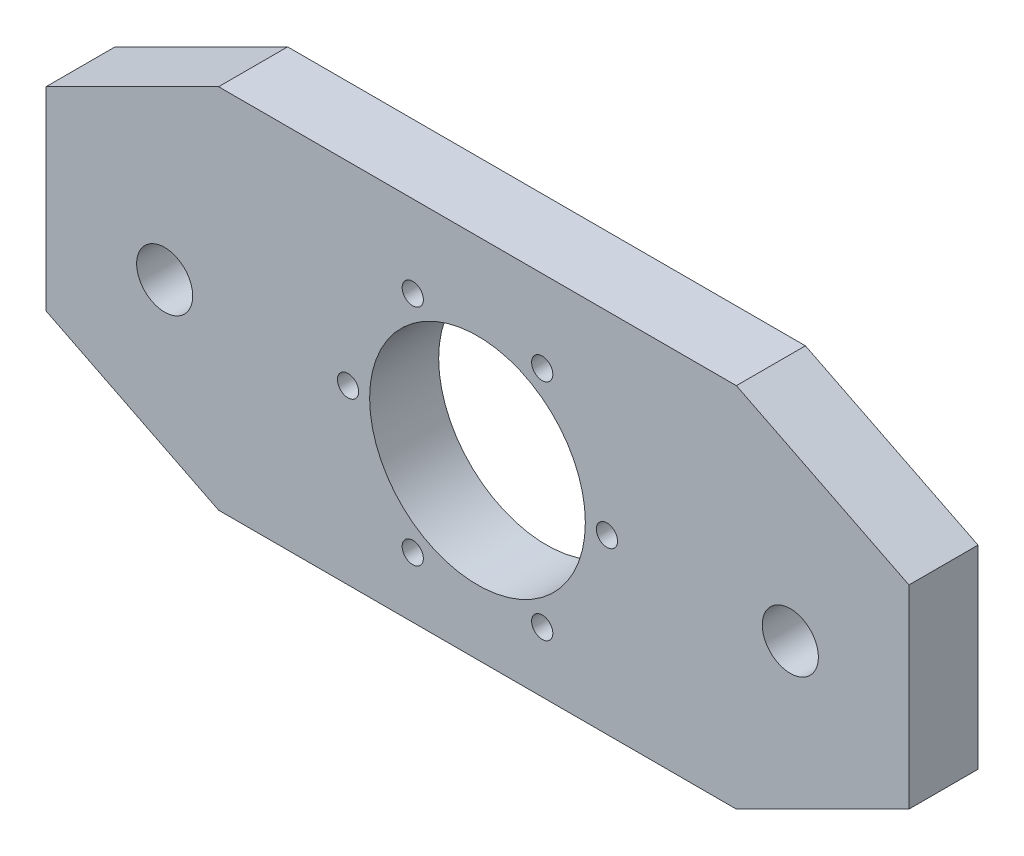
ISO-10303-21;
HEADER;
FILE_DESCRIPTION(('STEP AP214'),'2;1');
FILE_NAME('part.step','',(''),(''),'','','');
FILE_SCHEMA(('AUTOMOTIVE_DESIGN { 1 0 10303 214 1 1 1 1 }'));
ENDSEC;
DATA;
#1=APPLICATION_CONTEXT('core data for automotive mechanical design processes');
#2=APPLICATION_PROTOCOL_DEFINITION('international standard','automotive_design',2000,#1);
#3=PRODUCT_CONTEXT('',#1,'mechanical');
#4=PRODUCT('Part','Part','',(#3));
#5=PRODUCT_RELATED_PRODUCT_CATEGORY('part','',(#4));
#6=PRODUCT_DEFINITION_FORMATION('','',#4);
#7=PRODUCT_DEFINITION_CONTEXT('part definition',#1,'design');
#8=PRODUCT_DEFINITION('design','',#6,#7);
#9=PRODUCT_DEFINITION_SHAPE('','',#8);
#10=(LENGTH_UNIT() NAMED_UNIT(*) SI_UNIT(.MILLI.,.METRE.));
#11=(NAMED_UNIT(*) PLANE_ANGLE_UNIT() SI_UNIT($,.RADIAN.));
#12=(NAMED_UNIT(*) SI_UNIT($,.STERADIAN.) SOLID_ANGLE_UNIT());
#13=UNCERTAINTY_MEASURE_WITH_UNIT(LENGTH_MEASURE(1.E-05),#10,'distance_accuracy_value','');
#14=(GEOMETRIC_REPRESENTATION_CONTEXT(3) GLOBAL_UNCERTAINTY_ASSIGNED_CONTEXT((#13)) GLOBAL_UNIT_ASSIGNED_CONTEXT((#10,
#11,#12)) REPRESENTATION_CONTEXT('',''));
#15=CARTESIAN_POINT('',(0.,0.,0.));
#16=DIRECTION('',(0.,0.,1.));
#17=DIRECTION('',(1.,0.,0.));
#18=AXIS2_PLACEMENT_3D('',#15,#16,#17);
#19=CARTESIAN_POINT('',(69.2307696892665,37.6193639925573,0.));
#20=DIRECTION('',(0.,0.,1.));
#21=DIRECTION('',(1.,0.,0.));
#22=AXIS2_PLACEMENT_3D('',#19,#20,#21);
#23=PLANE('',#22);
#24=CARTESIAN_POINT('',(141.730769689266,35.1193639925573,0.));
#25=DIRECTION('',(0.,0.,-1.));
#26=DIRECTION('',(-1.,0.,0.));
#27=AXIS2_PLACEMENT_3D('',#24,#25,#26);
#28=CIRCLE('',#27,6.5);
#29=CARTESIAN_POINT('',(135.230769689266,35.1193639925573,0.));
#30=VERTEX_POINT('',#29);
#31=EDGE_CURVE('E152',#30,#30,#28,.F.);
#32=ORIENTED_EDGE('',*,*,#31,.T.);
#33=EDGE_LOOP('',(#32));
#34=FACE_BOUND('',#33,.T.);
#35=CARTESIAN_POINT('',(-3.26923031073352,35.1193639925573,0.));
#36=DIRECTION('',(0.,0.,-1.));
#37=DIRECTION('',(-1.,0.,0.));
#38=AXIS2_PLACEMENT_3D('',#35,#36,#37);
#39=CIRCLE('',#38,6.5);
#40=CARTESIAN_POINT('',(-9.76923031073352,35.1193639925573,0.));
#41=VERTEX_POINT('',#40);
#42=EDGE_CURVE('E178',#41,#41,#39,.F.);
#43=ORIENTED_EDGE('',*,*,#42,.T.);
#44=EDGE_LOOP('',(#43));
#45=FACE_BOUND('',#44,.T.);
#46=CARTESIAN_POINT('',(69.2307696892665,35.1193639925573,0.));
#47=DIRECTION('',(0.,0.,-1.));
#48=DIRECTION('',(-1.,0.,0.));
#49=AXIS2_PLACEMENT_3D('',#46,#47,#48);
#50=CIRCLE('',#49,25.);
#51=CARTESIAN_POINT('',(44.2307696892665,35.1193639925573,0.));
#52=VERTEX_POINT('',#51);
#53=EDGE_CURVE('E181',#52,#52,#50,.F.);
#54=ORIENTED_EDGE('',*,*,#53,.T.);
#55=EDGE_LOOP('',(#54));
#56=FACE_BOUND('',#55,.T.);
#57=CARTESIAN_POINT('',(99.2307696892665,35.1193639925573,0.));
#58=DIRECTION('',(0.,0.,-1.));
#59=DIRECTION('',(-1.,0.,0.));
#60=AXIS2_PLACEMENT_3D('',#57,#58,#59);
#61=CIRCLE('',#60,2.4585);
#62=CARTESIAN_POINT('',(96.7722696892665,35.1193639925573,0.));
#63=VERTEX_POINT('',#62);
#64=EDGE_CURVE('E184',#63,#63,#61,.F.);
#65=ORIENTED_EDGE('',*,*,#64,.T.);
#66=EDGE_LOOP('',(#65));
#67=FACE_BOUND('',#66,.T.);
#68=CARTESIAN_POINT('',(84.2307696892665,9.13860187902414,0.));
#69=DIRECTION('',(0.,0.,-1.));
#70=DIRECTION('',(-1.,0.,0.));
#71=AXIS2_PLACEMENT_3D('',#68,#69,#70);
#72=CIRCLE('',#71,2.45849999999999);
#73=CARTESIAN_POINT('',(81.7722696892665,9.13860187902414,0.));
#74=VERTEX_POINT('',#73);
#75=EDGE_CURVE('E187',#74,#74,#72,.F.);
#76=ORIENTED_EDGE('',*,*,#75,.T.);
#77=EDGE_LOOP('',(#76));
#78=FACE_BOUND('',#77,.T.);
#79=CARTESIAN_POINT('',(84.2307696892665,61.1001261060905,0.));
#80=DIRECTION('',(0.,0.,-1.));
#81=DIRECTION('',(-1.,0.,0.));
#82=AXIS2_PLACEMENT_3D('',#79,#80,#81);
#83=CIRCLE('',#82,2.45850000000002);
#84=CARTESIAN_POINT('',(81.7722696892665,61.1001261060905,0.));
#85=VERTEX_POINT('',#84);
#86=EDGE_CURVE('E190',#85,#85,#83,.F.);
#87=ORIENTED_EDGE('',*,*,#86,.T.);
#88=EDGE_LOOP('',(#87));
#89=FACE_BOUND('',#88,.T.);
#90=CARTESIAN_POINT('',(54.2307696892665,61.1001261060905,0.));
#91=DIRECTION('',(0.,0.,-1.));
#92=DIRECTION('',(-1.,0.,0.));
#93=AXIS2_PLACEMENT_3D('',#90,#91,#92);
#94=CIRCLE('',#93,2.45850000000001);
#95=CARTESIAN_POINT('',(51.7722696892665,61.1001261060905,0.));
#96=VERTEX_POINT('',#95);
#97=EDGE_CURVE('E193',#96,#96,#94,.F.);
#98=ORIENTED_EDGE('',*,*,#97,.T.);
#99=EDGE_LOOP('',(#98));
#100=FACE_BOUND('',#99,.T.);
#101=CARTESIAN_POINT('',(39.2307696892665,35.1193639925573,0.));
#102=DIRECTION('',(0.,0.,-1.));
#103=DIRECTION('',(-1.,0.,0.));
#104=AXIS2_PLACEMENT_3D('',#101,#102,#103);
#105=CIRCLE('',#104,2.4585);
#106=CARTESIAN_POINT('',(36.7722696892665,35.1193639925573,0.));
#107=VERTEX_POINT('',#106);
#108=EDGE_CURVE('E195',#107,#107,#105,.F.);
#109=ORIENTED_EDGE('',*,*,#108,.T.);
#110=EDGE_LOOP('',(#109));
#111=FACE_BOUND('',#110,.T.);
#112=CARTESIAN_POINT('',(54.2307696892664,9.13860187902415,0.));
#113=DIRECTION('',(0.,0.,-1.));
#114=DIRECTION('',(-1.,0.,0.));
#115=AXIS2_PLACEMENT_3D('',#112,#113,#114);
#116=CIRCLE('',#115,2.4585);
#117=CARTESIAN_POINT('',(51.7722696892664,9.13860187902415,0.));
#118=VERTEX_POINT('',#117);
#119=EDGE_CURVE('E20',#118,#118,#116,.F.);
#120=ORIENTED_EDGE('',*,*,#119,.T.);
#121=EDGE_LOOP('',(#120));
#122=FACE_BOUND('',#121,.T.);
#123=DIRECTION('',(1.,0.,0.));
#124=VECTOR('',#123,1.);
#125=CARTESIAN_POINT('',(9.23076968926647,80.1193639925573,0.));
#126=LINE('',#125,#124);
#127=CARTESIAN_POINT('',(129.230769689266,80.1193639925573,0.));
#128=VERTEX_POINT('',#127);
#129=CARTESIAN_POINT('',(9.2307696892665,80.1193639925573,0.));
#130=VERTEX_POINT('',#129);
#131=EDGE_CURVE('E68',#128,#130,#126,.F.);
#132=ORIENTED_EDGE('',*,*,#131,.F.);
#133=DIRECTION('',(-0.894427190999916,0.447213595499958,0.));
#134=VECTOR('',#133,1.);
#135=CARTESIAN_POINT('',(129.230769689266,80.1193639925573,0.));
#136=LINE('',#135,#134);
#137=CARTESIAN_POINT('',(169.230769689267,60.1193639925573,0.));
#138=VERTEX_POINT('',#137);
#139=EDGE_CURVE('E129',#138,#128,#136,.T.);
#140=ORIENTED_EDGE('',*,*,#139,.F.);
#141=DIRECTION('',(0.,1.,0.));
#142=VECTOR('',#141,1.);
#143=CARTESIAN_POINT('',(169.230769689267,60.1193639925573,0.));
#144=LINE('',#143,#142);
#145=CARTESIAN_POINT('',(169.230769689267,15.1193639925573,0.));
#146=VERTEX_POINT('',#145);
#147=EDGE_CURVE('E124',#146,#138,#144,.T.);
#148=ORIENTED_EDGE('',*,*,#147,.F.);
#149=DIRECTION('',(0.894427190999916,0.447213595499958,0.));
#150=VECTOR('',#149,1.);
#151=CARTESIAN_POINT('',(169.230769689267,15.1193639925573,0.));
#152=LINE('',#151,#150);
#153=CARTESIAN_POINT('',(129.230769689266,-4.88063600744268,0.));
#154=VERTEX_POINT('',#153);
#155=EDGE_CURVE('E119',#154,#146,#152,.T.);
#156=ORIENTED_EDGE('',*,*,#155,.F.);
#157=DIRECTION('',(1.,0.,0.));
#158=VECTOR('',#157,1.);
#159=CARTESIAN_POINT('',(129.230769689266,-4.88063600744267,0.));
#160=LINE('',#159,#158);
#161=CARTESIAN_POINT('',(9.23076968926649,-4.88063600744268,0.));
#162=VERTEX_POINT('',#161);
#163=EDGE_CURVE('E114',#162,#154,#160,.T.);
#164=ORIENTED_EDGE('',*,*,#163,.F.);
#165=DIRECTION('',(0.894427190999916,-0.447213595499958,0.));
#166=VECTOR('',#165,1.);
#167=CARTESIAN_POINT('',(9.23076968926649,-4.88063600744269,0.));
#168=LINE('',#167,#166);
#169=CARTESIAN_POINT('',(-30.7692303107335,15.1193639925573,0.));
#170=VERTEX_POINT('',#169);
#171=EDGE_CURVE('E109',#170,#162,#168,.T.);
#172=ORIENTED_EDGE('',*,*,#171,.F.);
#173=DIRECTION('',(0.,1.,0.));
#174=VECTOR('',#173,1.);
#175=CARTESIAN_POINT('',(-30.7692303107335,15.1193639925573,0.));
#176=LINE('',#175,#174);
#177=CARTESIAN_POINT('',(-30.7692303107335,60.1193639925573,0.));
#178=VERTEX_POINT('',#177);
#179=EDGE_CURVE('E96',#178,#170,#176,.F.);
#180=ORIENTED_EDGE('',*,*,#179,.F.);
#181=DIRECTION('',(-0.894427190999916,-0.447213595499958,0.));
#182=VECTOR('',#181,1.);
#183=CARTESIAN_POINT('',(-30.7692303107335,60.1193639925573,0.));
#184=LINE('',#183,#182);
#185=EDGE_CURVE('E94',#130,#178,#184,.T.);
#186=ORIENTED_EDGE('',*,*,#185,.F.);
#187=EDGE_LOOP('',(#132,#140,#148,#156,#164,#172,#180,#186));
#188=FACE_BOUND('',#187,.T.);
#189=ADVANCED_FACE('F16',(#34,#45,#56,#67,#78,#89,#100,#111,#122,#188),#23,.F.);
#190=CARTESIAN_POINT('',(9.23076968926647,80.1193639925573,0.));
#191=DIRECTION('',(0.,1.,0.));
#192=DIRECTION('',(0.,0.,1.));
#193=AXIS2_PLACEMENT_3D('',#190,#191,#192);
#194=PLANE('',#193);
#195=ORIENTED_EDGE('',*,*,#131,.T.);
#196=DIRECTION('',(0.,0.,1.));
#197=VECTOR('',#196,1.);
#198=CARTESIAN_POINT('',(9.23076968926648,80.1193639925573,0.));
#199=LINE('',#198,#197);
#200=CARTESIAN_POINT('',(9.23076968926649,80.1193639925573,16.));
#201=VERTEX_POINT('',#200);
#202=EDGE_CURVE('E88',#201,#130,#199,.F.);
#203=ORIENTED_EDGE('',*,*,#202,.F.);
#204=DIRECTION('',(1.,0.,0.));
#205=VECTOR('',#204,1.);
#206=CARTESIAN_POINT('',(69.2307696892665,80.1193639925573,16.));
#207=LINE('',#206,#205);
#208=CARTESIAN_POINT('',(129.230769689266,80.1193639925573,16.));
#209=VERTEX_POINT('',#208);
#210=EDGE_CURVE('E61',#209,#201,#207,.F.);
#211=ORIENTED_EDGE('',*,*,#210,.F.);
#212=DIRECTION('',(0.,0.,1.));
#213=VECTOR('',#212,1.);
#214=CARTESIAN_POINT('',(129.230769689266,80.1193639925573,0.));
#215=LINE('',#214,#213);
#216=EDGE_CURVE('E90',#128,#209,#215,.T.);
#217=ORIENTED_EDGE('',*,*,#216,.F.);
#218=EDGE_LOOP('',(#195,#203,#211,#217));
#219=FACE_BOUND('',#218,.T.);
#220=ADVANCED_FACE('F86',(#219),#194,.T.);
#221=CARTESIAN_POINT('',(-30.7692303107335,60.1193639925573,0.));
#222=DIRECTION('',(-0.447213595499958,0.894427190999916,0.));
#223=DIRECTION('',(-0.894427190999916,-0.447213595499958,0.));
#224=AXIS2_PLACEMENT_3D('',#221,#222,#223);
#225=PLANE('',#224);
#226=ORIENTED_EDGE('',*,*,#185,.T.);
#227=DIRECTION('',(0.,0.,1.));
#228=VECTOR('',#227,1.);
#229=CARTESIAN_POINT('',(-30.7692303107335,60.1193639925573,0.));
#230=LINE('',#229,#228);
#231=CARTESIAN_POINT('',(-30.7692303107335,60.1193639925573,16.));
#232=VERTEX_POINT('',#231);
#233=EDGE_CURVE('E99',#232,#178,#230,.F.);
#234=ORIENTED_EDGE('',*,*,#233,.F.);
#235=DIRECTION('',(-0.894427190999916,-0.447213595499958,0.));
#236=VECTOR('',#235,1.);
#237=CARTESIAN_POINT('',(9.23076968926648,80.1193639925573,16.));
#238=LINE('',#237,#236);
#239=EDGE_CURVE('E103',#201,#232,#238,.T.);
#240=ORIENTED_EDGE('',*,*,#239,.F.);
#241=ORIENTED_EDGE('',*,*,#202,.T.);
#242=EDGE_LOOP('',(#226,#234,#240,#241));
#243=FACE_BOUND('',#242,.T.);
#244=ADVANCED_FACE('F101',(#243),#225,.T.);
#245=CARTESIAN_POINT('',(-30.7692303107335,15.1193639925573,0.));
#246=DIRECTION('',(-1.,0.,0.));
#247=DIRECTION('',(0.,0.,1.));
#248=AXIS2_PLACEMENT_3D('',#245,#246,#247);
#249=PLANE('',#248);
#250=ORIENTED_EDGE('',*,*,#179,.T.);
#251=DIRECTION('',(0.,0.,1.));
#252=VECTOR('',#251,1.);
#253=CARTESIAN_POINT('',(-30.7692303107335,15.1193639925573,0.));
#254=LINE('',#253,#252);
#255=CARTESIAN_POINT('',(-30.7692303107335,15.1193639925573,16.));
#256=VERTEX_POINT('',#255);
#257=EDGE_CURVE('E107',#256,#170,#254,.F.);
#258=ORIENTED_EDGE('',*,*,#257,.F.);
#259=DIRECTION('',(0.,1.,0.));
#260=VECTOR('',#259,1.);
#261=CARTESIAN_POINT('',(-30.7692303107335,37.6193639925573,16.));
#262=LINE('',#261,#260);
#263=EDGE_CURVE('E148',#232,#256,#262,.F.);
#264=ORIENTED_EDGE('',*,*,#263,.F.);
#265=ORIENTED_EDGE('',*,*,#233,.T.);
#266=EDGE_LOOP('',(#250,#258,#264,#265));
#267=FACE_BOUND('',#266,.T.);
#268=ADVANCED_FACE('F243',(#267),#249,.T.);
#269=CARTESIAN_POINT('',(9.23076968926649,-4.88063600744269,0.));
#270=DIRECTION('',(-0.447213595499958,-0.894427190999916,0.));
#271=DIRECTION('',(0.894427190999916,-0.447213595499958,0.));
#272=AXIS2_PLACEMENT_3D('',#269,#270,#271);
#273=PLANE('',#272);
#274=ORIENTED_EDGE('',*,*,#171,.T.);
#275=DIRECTION('',(0.,0.,-1.));
#276=VECTOR('',#275,1.);
#277=CARTESIAN_POINT('',(9.23076968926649,-4.88063600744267,0.));
#278=LINE('',#277,#276);
#279=CARTESIAN_POINT('',(9.23076968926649,-4.88063600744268,16.));
#280=VERTEX_POINT('',#279);
#281=EDGE_CURVE('E111',#280,#162,#278,.T.);
#282=ORIENTED_EDGE('',*,*,#281,.F.);
#283=DIRECTION('',(0.894427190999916,-0.447213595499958,0.));
#284=VECTOR('',#283,1.);
#285=CARTESIAN_POINT('',(-30.7692303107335,15.1193639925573,16.));
#286=LINE('',#285,#284);
#287=EDGE_CURVE('E145',#256,#280,#286,.T.);
#288=ORIENTED_EDGE('',*,*,#287,.F.);
#289=ORIENTED_EDGE('',*,*,#257,.T.);
#290=EDGE_LOOP('',(#274,#282,#288,#289));
#291=FACE_BOUND('',#290,.T.);
#292=ADVANCED_FACE('F239',(#291),#273,.T.);
#293=CARTESIAN_POINT('',(129.230769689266,-4.88063600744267,0.));
#294=DIRECTION('',(0.,-1.,0.));
#295=DIRECTION('',(0.,0.,-1.));
#296=AXIS2_PLACEMENT_3D('',#293,#294,#295);
#297=PLANE('',#296);
#298=ORIENTED_EDGE('',*,*,#163,.T.);
#299=DIRECTION('',(0.,0.,1.));
#300=VECTOR('',#299,1.);
#301=CARTESIAN_POINT('',(129.230769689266,-4.88063600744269,0.));
#302=LINE('',#301,#300);
#303=CARTESIAN_POINT('',(129.230769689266,-4.88063600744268,16.));
#304=VERTEX_POINT('',#303);
#305=EDGE_CURVE('E116',#304,#154,#302,.F.);
#306=ORIENTED_EDGE('',*,*,#305,.F.);
#307=DIRECTION('',(1.,0.,0.));
#308=VECTOR('',#307,1.);
#309=CARTESIAN_POINT('',(69.2307696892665,-4.88063600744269,16.));
#310=LINE('',#309,#308);
#311=EDGE_CURVE('E142',#280,#304,#310,.T.);
#312=ORIENTED_EDGE('',*,*,#311,.F.);
#313=ORIENTED_EDGE('',*,*,#281,.T.);
#314=EDGE_LOOP('',(#298,#306,#312,#313));
#315=FACE_BOUND('',#314,.T.);
#316=ADVANCED_FACE('F235',(#315),#297,.T.);
#317=CARTESIAN_POINT('',(169.230769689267,15.1193639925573,0.));
#318=DIRECTION('',(0.447213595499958,-0.894427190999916,0.));
#319=DIRECTION('',(0.894427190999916,0.447213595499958,0.));
#320=AXIS2_PLACEMENT_3D('',#317,#318,#319);
#321=PLANE('',#320);
#322=ORIENTED_EDGE('',*,*,#155,.T.);
#323=DIRECTION('',(0.,0.,-1.));
#324=VECTOR('',#323,1.);
#325=CARTESIAN_POINT('',(169.230769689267,15.1193639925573,0.));
#326=LINE('',#325,#324);
#327=CARTESIAN_POINT('',(169.230769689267,15.1193639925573,16.));
#328=VERTEX_POINT('',#327);
#329=EDGE_CURVE('E121',#328,#146,#326,.T.);
#330=ORIENTED_EDGE('',*,*,#329,.F.);
#331=DIRECTION('',(0.894427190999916,0.447213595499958,0.));
#332=VECTOR('',#331,1.);
#333=CARTESIAN_POINT('',(129.230769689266,-4.88063600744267,16.));
#334=LINE('',#333,#332);
#335=EDGE_CURVE('E139',#304,#328,#334,.T.);
#336=ORIENTED_EDGE('',*,*,#335,.F.);
#337=ORIENTED_EDGE('',*,*,#305,.T.);
#338=EDGE_LOOP('',(#322,#330,#336,#337));
#339=FACE_BOUND('',#338,.T.);
#340=ADVANCED_FACE('F232',(#339),#321,.T.);
#341=CARTESIAN_POINT('',(169.230769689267,60.1193639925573,0.));
#342=DIRECTION('',(1.,0.,0.));
#343=DIRECTION('',(0.,0.,-1.));
#344=AXIS2_PLACEMENT_3D('',#341,#342,#343);
#345=PLANE('',#344);
#346=ORIENTED_EDGE('',*,*,#147,.T.);
#347=DIRECTION('',(0.,0.,1.));
#348=VECTOR('',#347,1.);
#349=CARTESIAN_POINT('',(169.230769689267,60.1193639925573,0.));
#350=LINE('',#349,#348);
#351=CARTESIAN_POINT('',(169.230769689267,60.1193639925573,16.));
#352=VERTEX_POINT('',#351);
#353=EDGE_CURVE('E35',#352,#138,#350,.F.);
#354=ORIENTED_EDGE('',*,*,#353,.F.);
#355=DIRECTION('',(0.,1.,0.));
#356=VECTOR('',#355,1.);
#357=CARTESIAN_POINT('',(169.230769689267,37.6193639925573,16.));
#358=LINE('',#357,#356);
#359=EDGE_CURVE('E136',#328,#352,#358,.T.);
#360=ORIENTED_EDGE('',*,*,#359,.F.);
#361=ORIENTED_EDGE('',*,*,#329,.T.);
#362=EDGE_LOOP('',(#346,#354,#360,#361));
#363=FACE_BOUND('',#362,.T.);
#364=ADVANCED_FACE('F216',(#363),#345,.T.);
#365=CARTESIAN_POINT('',(129.230769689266,80.1193639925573,0.));
#366=DIRECTION('',(0.447213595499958,0.894427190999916,0.));
#367=DIRECTION('',(-0.894427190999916,0.447213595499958,0.));
#368=AXIS2_PLACEMENT_3D('',#365,#366,#367);
#369=PLANE('',#368);
#370=ORIENTED_EDGE('',*,*,#139,.T.);
#371=ORIENTED_EDGE('',*,*,#216,.T.);
#372=DIRECTION('',(-0.894427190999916,0.447213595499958,0.));
#373=VECTOR('',#372,1.);
#374=CARTESIAN_POINT('',(169.230769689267,60.1193639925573,16.));
#375=LINE('',#374,#373);
#376=EDGE_CURVE('E132',#352,#209,#375,.T.);
#377=ORIENTED_EDGE('',*,*,#376,.F.);
#378=ORIENTED_EDGE('',*,*,#353,.T.);
#379=EDGE_LOOP('',(#370,#371,#377,#378));
#380=FACE_BOUND('',#379,.T.);
#381=ADVANCED_FACE('F206',(#380),#369,.T.);
#382=CARTESIAN_POINT('',(54.2307696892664,9.13860187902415,16.));
#383=DIRECTION('',(0.,0.,-1.));
#384=DIRECTION('',(-1.,0.,0.));
#385=AXIS2_PLACEMENT_3D('',#382,#383,#384);
#386=CYLINDRICAL_SURFACE('',#385,2.4585);
#387=CARTESIAN_POINT('',(54.2307696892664,9.13860187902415,16.));
#388=DIRECTION('',(0.,0.,-1.));
#389=DIRECTION('',(-1.,0.,0.));
#390=AXIS2_PLACEMENT_3D('',#387,#388,#389);
#391=CIRCLE('',#390,2.4585);
#392=CARTESIAN_POINT('',(51.7722696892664,9.13860187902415,16.));
#393=VERTEX_POINT('',#392);
#394=EDGE_CURVE('E135',#393,#393,#391,.T.);
#395=ORIENTED_EDGE('',*,*,#394,.F.);
#396=EDGE_LOOP('',(#395));
#397=FACE_BOUND('',#396,.T.);
#398=ORIENTED_EDGE('',*,*,#119,.F.);
#399=EDGE_LOOP('',(#398));
#400=FACE_BOUND('',#399,.T.);
#401=ADVANCED_FACE('F203',(#397,#400),#386,.F.);
#402=CARTESIAN_POINT('',(39.2307696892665,35.1193639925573,16.));
#403=DIRECTION('',(0.,0.,-1.));
#404=DIRECTION('',(-1.,0.,0.));
#405=AXIS2_PLACEMENT_3D('',#402,#403,#404);
#406=CYLINDRICAL_SURFACE('',#405,2.4585);
#407=CARTESIAN_POINT('',(39.2307696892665,35.1193639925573,16.));
#408=DIRECTION('',(0.,0.,-1.));
#409=DIRECTION('',(-1.,0.,0.));
#410=AXIS2_PLACEMENT_3D('',#407,#408,#409);
#411=CIRCLE('',#410,2.4585);
#412=CARTESIAN_POINT('',(36.7722696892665,35.1193639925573,16.));
#413=VERTEX_POINT('',#412);
#414=EDGE_CURVE('E171',#413,#413,#411,.T.);
#415=ORIENTED_EDGE('',*,*,#414,.F.);
#416=EDGE_LOOP('',(#415));
#417=FACE_BOUND('',#416,.T.);
#418=ORIENTED_EDGE('',*,*,#108,.F.);
#419=EDGE_LOOP('',(#418));
#420=FACE_BOUND('',#419,.T.);
#421=ADVANCED_FACE('F205',(#417,#420),#406,.F.);
#422=CARTESIAN_POINT('',(54.2307696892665,61.1001261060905,16.));
#423=DIRECTION('',(0.,0.,-1.));
#424=DIRECTION('',(-1.,0.,0.));
#425=AXIS2_PLACEMENT_3D('',#422,#423,#424);
#426=CYLINDRICAL_SURFACE('',#425,2.45850000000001);
#427=CARTESIAN_POINT('',(54.2307696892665,61.1001261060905,16.));
#428=DIRECTION('',(0.,0.,-1.));
#429=DIRECTION('',(-1.,0.,0.));
#430=AXIS2_PLACEMENT_3D('',#427,#428,#429);
#431=CIRCLE('',#430,2.45850000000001);
#432=CARTESIAN_POINT('',(51.7722696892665,61.1001261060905,16.));
#433=VERTEX_POINT('',#432);
#434=EDGE_CURVE('E168',#433,#433,#431,.T.);
#435=ORIENTED_EDGE('',*,*,#434,.F.);
#436=EDGE_LOOP('',(#435));
#437=FACE_BOUND('',#436,.T.);
#438=ORIENTED_EDGE('',*,*,#97,.F.);
#439=EDGE_LOOP('',(#438));
#440=FACE_BOUND('',#439,.T.);
#441=ADVANCED_FACE('F212',(#437,#440),#426,.F.);
#442=CARTESIAN_POINT('',(84.2307696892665,61.1001261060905,16.));
#443=DIRECTION('',(0.,0.,-1.));
#444=DIRECTION('',(-1.,0.,0.));
#445=AXIS2_PLACEMENT_3D('',#442,#443,#444);
#446=CYLINDRICAL_SURFACE('',#445,2.45850000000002);
#447=CARTESIAN_POINT('',(84.2307696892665,61.1001261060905,16.));
#448=DIRECTION('',(0.,0.,-1.));
#449=DIRECTION('',(-1.,0.,0.));
#450=AXIS2_PLACEMENT_3D('',#447,#448,#449);
#451=CIRCLE('',#450,2.45850000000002);
#452=CARTESIAN_POINT('',(81.7722696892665,61.1001261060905,16.));
#453=VERTEX_POINT('',#452);
#454=EDGE_CURVE('E165',#453,#453,#451,.T.);
#455=ORIENTED_EDGE('',*,*,#454,.F.);
#456=EDGE_LOOP('',(#455));
#457=FACE_BOUND('',#456,.T.);
#458=ORIENTED_EDGE('',*,*,#86,.F.);
#459=EDGE_LOOP('',(#458));
#460=FACE_BOUND('',#459,.T.);
#461=ADVANCED_FACE('F270',(#457,#460),#446,.F.);
#462=CARTESIAN_POINT('',(84.2307696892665,9.13860187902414,16.));
#463=DIRECTION('',(0.,0.,-1.));
#464=DIRECTION('',(-1.,0.,0.));
#465=AXIS2_PLACEMENT_3D('',#462,#463,#464);
#466=CYLINDRICAL_SURFACE('',#465,2.45849999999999);
#467=CARTESIAN_POINT('',(84.2307696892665,9.13860187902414,16.));
#468=DIRECTION('',(0.,0.,-1.));
#469=DIRECTION('',(-1.,0.,0.));
#470=AXIS2_PLACEMENT_3D('',#467,#468,#469);
#471=CIRCLE('',#470,2.45849999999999);
#472=CARTESIAN_POINT('',(81.7722696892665,9.13860187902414,16.));
#473=VERTEX_POINT('',#472);
#474=EDGE_CURVE('E162',#473,#473,#471,.T.);
#475=ORIENTED_EDGE('',*,*,#474,.F.);
#476=EDGE_LOOP('',(#475));
#477=FACE_BOUND('',#476,.T.);
#478=ORIENTED_EDGE('',*,*,#75,.F.);
#479=EDGE_LOOP('',(#478));
#480=FACE_BOUND('',#479,.T.);
#481=ADVANCED_FACE('F275',(#477,#480),#466,.F.);
#482=CARTESIAN_POINT('',(99.2307696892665,35.1193639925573,16.));
#483=DIRECTION('',(0.,0.,-1.));
#484=DIRECTION('',(-1.,0.,0.));
#485=AXIS2_PLACEMENT_3D('',#482,#483,#484);
#486=CYLINDRICAL_SURFACE('',#485,2.4585);
#487=CARTESIAN_POINT('',(99.2307696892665,35.1193639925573,16.));
#488=DIRECTION('',(0.,0.,-1.));
#489=DIRECTION('',(-1.,0.,0.));
#490=AXIS2_PLACEMENT_3D('',#487,#488,#489);
#491=CIRCLE('',#490,2.4585);
#492=CARTESIAN_POINT('',(96.7722696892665,35.1193639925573,16.));
#493=VERTEX_POINT('',#492);
#494=EDGE_CURVE('E159',#493,#493,#491,.T.);
#495=ORIENTED_EDGE('',*,*,#494,.F.);
#496=EDGE_LOOP('',(#495));
#497=FACE_BOUND('',#496,.T.);
#498=ORIENTED_EDGE('',*,*,#64,.F.);
#499=EDGE_LOOP('',(#498));
#500=FACE_BOUND('',#499,.T.);
#501=ADVANCED_FACE('F282',(#497,#500),#486,.F.);
#502=CARTESIAN_POINT('',(69.2307696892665,35.1193639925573,16.));
#503=DIRECTION('',(0.,0.,-1.));
#504=DIRECTION('',(-1.,0.,0.));
#505=AXIS2_PLACEMENT_3D('',#502,#503,#504);
#506=CYLINDRICAL_SURFACE('',#505,25.);
#507=CARTESIAN_POINT('',(69.2307696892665,35.1193639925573,16.));
#508=DIRECTION('',(0.,0.,-1.));
#509=DIRECTION('',(-1.,0.,0.));
#510=AXIS2_PLACEMENT_3D('',#507,#508,#509);
#511=CIRCLE('',#510,25.);
#512=CARTESIAN_POINT('',(44.2307696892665,35.1193639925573,16.));
#513=VERTEX_POINT('',#512);
#514=EDGE_CURVE('E156',#513,#513,#511,.T.);
#515=ORIENTED_EDGE('',*,*,#514,.F.);
#516=EDGE_LOOP('',(#515));
#517=FACE_BOUND('',#516,.T.);
#518=ORIENTED_EDGE('',*,*,#53,.F.);
#519=EDGE_LOOP('',(#518));
#520=FACE_BOUND('',#519,.T.);
#521=ADVANCED_FACE('F286',(#517,#520),#506,.F.);
#522=CARTESIAN_POINT('',(-3.26923031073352,35.1193639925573,16.));
#523=DIRECTION('',(0.,0.,-1.));
#524=DIRECTION('',(-1.,0.,0.));
#525=AXIS2_PLACEMENT_3D('',#522,#523,#524);
#526=CYLINDRICAL_SURFACE('',#525,6.5);
#527=CARTESIAN_POINT('',(-3.26923031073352,35.1193639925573,16.));
#528=DIRECTION('',(0.,0.,-1.));
#529=DIRECTION('',(-1.,0.,0.));
#530=AXIS2_PLACEMENT_3D('',#527,#528,#529);
#531=CIRCLE('',#530,6.5);
#532=CARTESIAN_POINT('',(-9.76923031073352,35.1193639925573,16.));
#533=VERTEX_POINT('',#532);
#534=EDGE_CURVE('E26',#533,#533,#531,.T.);
#535=ORIENTED_EDGE('',*,*,#534,.F.);
#536=EDGE_LOOP('',(#535));
#537=FACE_BOUND('',#536,.T.);
#538=ORIENTED_EDGE('',*,*,#42,.F.);
#539=EDGE_LOOP('',(#538));
#540=FACE_BOUND('',#539,.T.);
#541=ADVANCED_FACE('F226',(#537,#540),#526,.F.);
#542=CARTESIAN_POINT('',(141.730769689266,35.1193639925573,16.));
#543=DIRECTION('',(0.,0.,-1.));
#544=DIRECTION('',(-1.,0.,0.));
#545=AXIS2_PLACEMENT_3D('',#542,#543,#544);
#546=CYLINDRICAL_SURFACE('',#545,6.5);
#547=CARTESIAN_POINT('',(141.730769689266,35.1193639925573,16.));
#548=DIRECTION('',(0.,0.,-1.));
#549=DIRECTION('',(-1.,0.,0.));
#550=AXIS2_PLACEMENT_3D('',#547,#548,#549);
#551=CIRCLE('',#550,6.5);
#552=CARTESIAN_POINT('',(135.230769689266,35.1193639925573,16.));
#553=VERTEX_POINT('',#552);
#554=EDGE_CURVE('E10',#553,#553,#551,.T.);
#555=ORIENTED_EDGE('',*,*,#554,.F.);
#556=EDGE_LOOP('',(#555));
#557=FACE_BOUND('',#556,.T.);
#558=ORIENTED_EDGE('',*,*,#31,.F.);
#559=EDGE_LOOP('',(#558));
#560=FACE_BOUND('',#559,.T.);
#561=ADVANCED_FACE('F18',(#557,#560),#546,.F.);
#562=CARTESIAN_POINT('',(69.2307696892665,37.6193639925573,16.));
#563=DIRECTION('',(0.,0.,1.));
#564=DIRECTION('',(1.,0.,0.));
#565=AXIS2_PLACEMENT_3D('',#562,#563,#564);
#566=PLANE('',#565);
#567=ORIENTED_EDGE('',*,*,#554,.T.);
#568=EDGE_LOOP('',(#567));
#569=FACE_BOUND('',#568,.T.);
#570=ORIENTED_EDGE('',*,*,#534,.T.);
#571=EDGE_LOOP('',(#570));
#572=FACE_BOUND('',#571,.T.);
#573=ORIENTED_EDGE('',*,*,#514,.T.);
#574=EDGE_LOOP('',(#573));
#575=FACE_BOUND('',#574,.T.);
#576=ORIENTED_EDGE('',*,*,#494,.T.);
#577=EDGE_LOOP('',(#576));
#578=FACE_BOUND('',#577,.T.);
#579=ORIENTED_EDGE('',*,*,#474,.T.);
#580=EDGE_LOOP('',(#579));
#581=FACE_BOUND('',#580,.T.);
#582=ORIENTED_EDGE('',*,*,#454,.T.);
#583=EDGE_LOOP('',(#582));
#584=FACE_BOUND('',#583,.T.);
#585=ORIENTED_EDGE('',*,*,#434,.T.);
#586=EDGE_LOOP('',(#585));
#587=FACE_BOUND('',#586,.T.);
#588=ORIENTED_EDGE('',*,*,#414,.T.);
#589=EDGE_LOOP('',(#588));
#590=FACE_BOUND('',#589,.T.);
#591=ORIENTED_EDGE('',*,*,#394,.T.);
#592=EDGE_LOOP('',(#591));
#593=FACE_BOUND('',#592,.T.);
#594=ORIENTED_EDGE('',*,*,#359,.T.);
#595=ORIENTED_EDGE('',*,*,#376,.T.);
#596=ORIENTED_EDGE('',*,*,#210,.T.);
#597=ORIENTED_EDGE('',*,*,#239,.T.);
#598=ORIENTED_EDGE('',*,*,#263,.T.);
#599=ORIENTED_EDGE('',*,*,#287,.T.);
#600=ORIENTED_EDGE('',*,*,#311,.T.);
#601=ORIENTED_EDGE('',*,*,#335,.T.);
#602=EDGE_LOOP('',(#594,#595,#596,#597,#598,#599,#600,#601));
#603=FACE_BOUND('',#602,.T.);
#604=ADVANCED_FACE('F221',(#569,#572,#575,#578,#581,#584,#587,#590,#593,#603),#566,.T.);
#605=CLOSED_SHELL('',(#189,#220,#244,#268,#292,#316,#340,#364,#381,#401,#421,#441,#461,#481,
#501,#521,#541,#561,#604));
#606=MANIFOLD_SOLID_BREP('B1',#605);
#607=ADVANCED_BREP_SHAPE_REPRESENTATION('',(#18,#606),#14);
#608=SHAPE_DEFINITION_REPRESENTATION(#9,#607);
ENDSEC;
END-ISO-10303-21;
